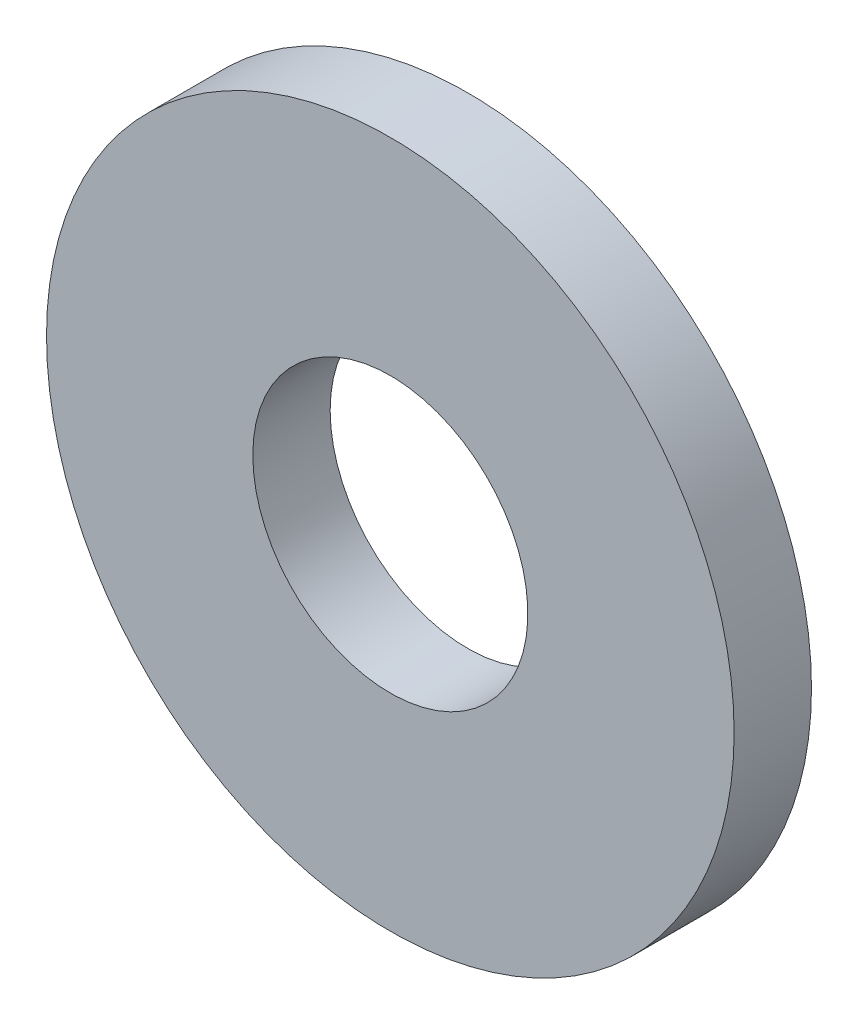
from build123d import *

# Parameters (mm, degrees)
E_CORPS_R              = 20
CORPS_DEPTH            = 4.5
E_PER_AGE_R            = 8
DIAM_TRE_NOMINAL_DEPTH = 29.640006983


with BuildPart() as part:
    # E_corps → Corps (new body)
    with BuildSketch(Plane.XY):
        Circle(E_CORPS_R)
    extrude(amount=CORPS_DEPTH)

    # E_per_age → Diam_tre_nominal (cut, through all)
    with BuildSketch(Plane(origin=(0, 0, 0), x_dir=(-1, 0, 0), z_dir=(0, 0, -1))):
        Circle(E_PER_AGE_R)
    extrude(amount=-DIAM_TRE_NOMINAL_DEPTH, mode=Mode.SUBTRACT)


solid = part.part
